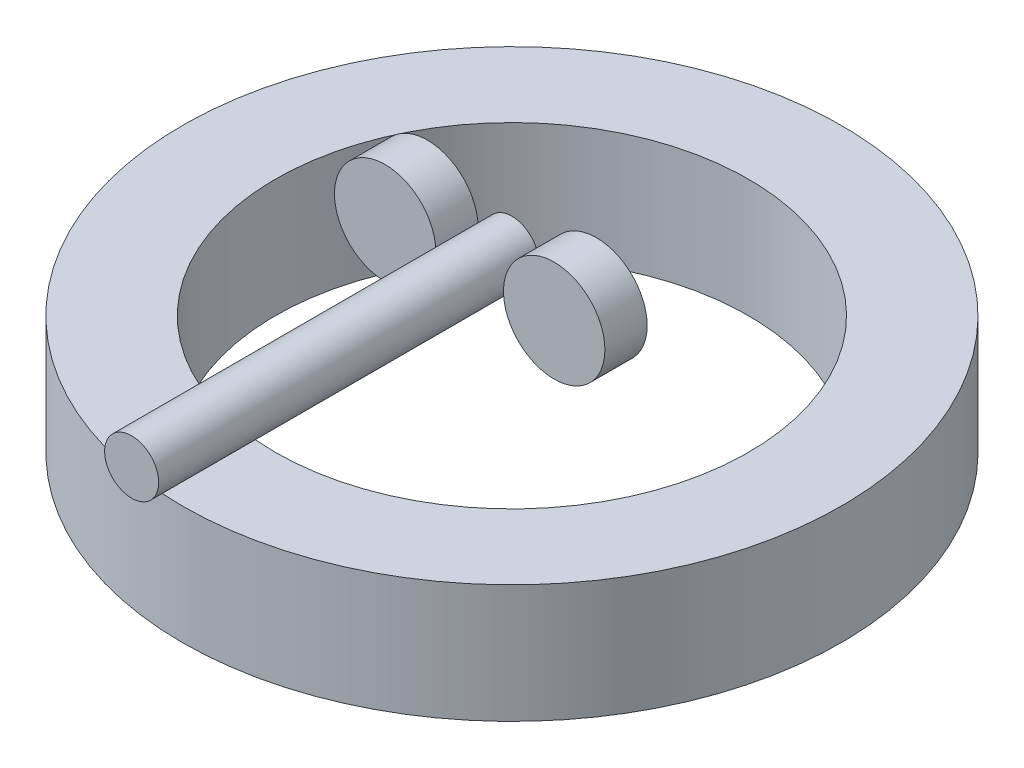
from build123d import *

# Parameters (mm, degrees)
SKETCH1_R             = 9750
SKETCH1_R_2           = 7000
BOSS_EXTRUDE1_DEPTH   = 3500
SKETCH2_R             = 800
BOSS_EXTRUDE2_DEPTH   = 11250
SKETCH4_R             = 1500
BOSS_EXTRUDE4_DEPTH   = 1250
BOSS_EXTRUDE4_2_DEPTH = 1250


with BuildPart() as part:
    # Sketch1 → Boss-Extrude1 (new body)
    with BuildSketch(Plane(origin=(0, 0, 0), x_dir=(1, 0, 0), z_dir=(0, 1, 0))):
        with Locations(Location((0, 0, 0), (0, 0, 270))):
            Circle(SKETCH1_R)
        with Locations(Location((0, 0, 0), (0, 0, 270))):
            Circle(SKETCH1_R_2, mode=Mode.SUBTRACT)
    extrude(amount=-BOSS_EXTRUDE1_DEPTH)


with BuildPart() as body_2:
    # Sketch2 → Boss-Extrude2 (new body)
    with BuildSketch(Plane.XY):
        with Locations((0, 1750)):
            Circle(SKETCH2_R)
    extrude(amount=BOSS_EXTRUDE2_DEPTH)


with BuildPart() as body_3:
    # Sketch4 → Boss-Extrude4 (new body)
    with BuildSketch(Plane.XY):
        with Locations((-2500, 1750)):
            Circle(SKETCH4_R)
    extrude(amount=BOSS_EXTRUDE4_DEPTH)


with BuildPart() as body_4:
    # Sketch4 → Boss-Extrude4 2 (new body)
    with BuildSketch(Plane.XY):
        with Locations((2500, 1750)):
            Circle(SKETCH4_R)
    extrude(amount=BOSS_EXTRUDE4_2_DEPTH)


solid = Compound([part.part, body_2.part, body_3.part, body_4.part])
